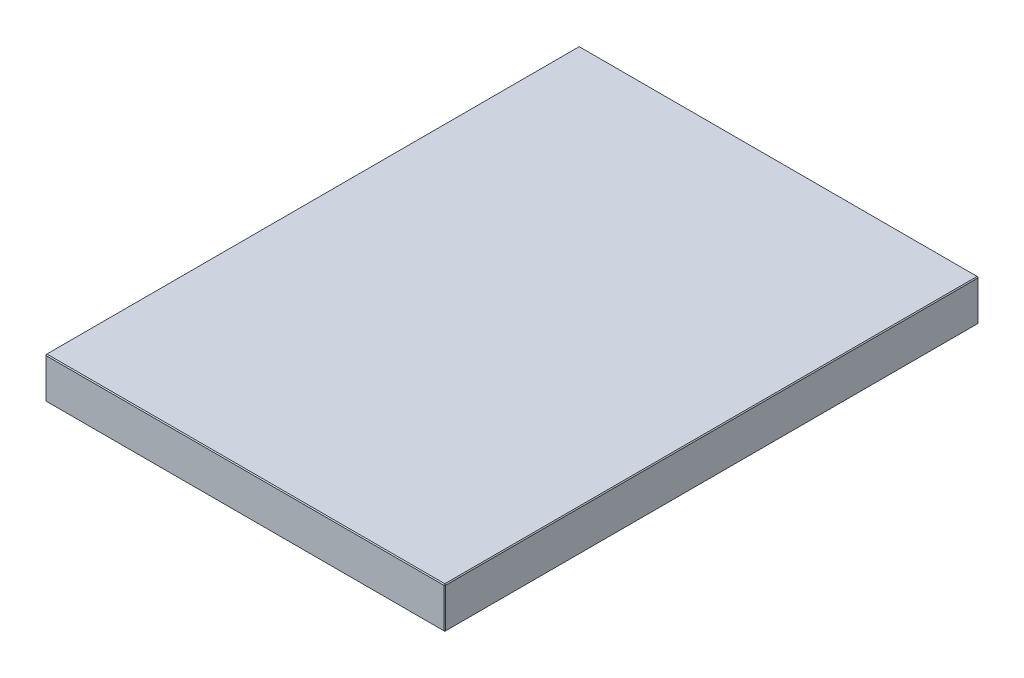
ISO-10303-21;
HEADER;
FILE_DESCRIPTION(('STEP AP214'),'2;1');
FILE_NAME('part.step','',(''),(''),'','','');
FILE_SCHEMA(('AUTOMOTIVE_DESIGN { 1 0 10303 214 1 1 1 1 }'));
ENDSEC;
DATA;
#1=APPLICATION_CONTEXT('core data for automotive mechanical design processes');
#2=APPLICATION_PROTOCOL_DEFINITION('international standard','automotive_design',2000,#1);
#3=PRODUCT_CONTEXT('',#1,'mechanical');
#4=PRODUCT('Part','Part','',(#3));
#5=PRODUCT_RELATED_PRODUCT_CATEGORY('part','',(#4));
#6=PRODUCT_DEFINITION_FORMATION('','',#4);
#7=PRODUCT_DEFINITION_CONTEXT('part definition',#1,'design');
#8=PRODUCT_DEFINITION('design','',#6,#7);
#9=PRODUCT_DEFINITION_SHAPE('','',#8);
#10=(LENGTH_UNIT() NAMED_UNIT(*) SI_UNIT(.MILLI.,.METRE.));
#11=(NAMED_UNIT(*) PLANE_ANGLE_UNIT() SI_UNIT($,.RADIAN.));
#12=(NAMED_UNIT(*) SI_UNIT($,.STERADIAN.) SOLID_ANGLE_UNIT());
#13=UNCERTAINTY_MEASURE_WITH_UNIT(LENGTH_MEASURE(1.E-05),#10,'distance_accuracy_value','');
#14=(GEOMETRIC_REPRESENTATION_CONTEXT(3) GLOBAL_UNCERTAINTY_ASSIGNED_CONTEXT((#13)) GLOBAL_UNIT_ASSIGNED_CONTEXT((#10,
#11,#12)) REPRESENTATION_CONTEXT('',''));
#15=CARTESIAN_POINT('',(0.,0.,0.));
#16=DIRECTION('',(0.,0.,1.));
#17=DIRECTION('',(1.,0.,0.));
#18=AXIS2_PLACEMENT_3D('',#15,#16,#17);
#19=CARTESIAN_POINT('',(223.,46.,298.));
#20=DIRECTION('',(-1.,0.,0.));
#21=DIRECTION('',(0.,0.,1.));
#22=AXIS2_PLACEMENT_3D('',#19,#20,#21);
#23=PLANE('',#22);
#24=DIRECTION('',(0.,0.,-1.));
#25=VECTOR('',#24,1.);
#26=CARTESIAN_POINT('',(223.,1.,-298.));
#27=LINE('',#26,#25);
#28=CARTESIAN_POINT('',(223.,1.,297.));
#29=VERTEX_POINT('',#28);
#30=CARTESIAN_POINT('',(223.,1.,-297.));
#31=VERTEX_POINT('',#30);
#32=EDGE_CURVE('E151',#29,#31,#27,.T.);
#33=ORIENTED_EDGE('',*,*,#32,.T.);
#34=DIRECTION('',(0.,1.,0.));
#35=VECTOR('',#34,1.);
#36=CARTESIAN_POINT('',(223.,46.,-297.));
#37=LINE('',#36,#35);
#38=CARTESIAN_POINT('',(223.,45.,-297.));
#39=VERTEX_POINT('',#38);
#40=EDGE_CURVE('E153',#31,#39,#37,.T.);
#41=ORIENTED_EDGE('',*,*,#40,.T.);
#42=DIRECTION('',(0.,0.,1.));
#43=VECTOR('',#42,1.);
#44=CARTESIAN_POINT('',(223.,45.,298.));
#45=LINE('',#44,#43);
#46=CARTESIAN_POINT('',(223.,45.,297.));
#47=VERTEX_POINT('',#46);
#48=EDGE_CURVE('E147',#39,#47,#45,.T.);
#49=ORIENTED_EDGE('',*,*,#48,.T.);
#50=DIRECTION('',(0.,-1.,0.));
#51=VECTOR('',#50,1.);
#52=CARTESIAN_POINT('',(223.,46.,297.));
#53=LINE('',#52,#51);
#54=EDGE_CURVE('E149',#47,#29,#53,.T.);
#55=ORIENTED_EDGE('',*,*,#54,.T.);
#56=EDGE_LOOP('',(#33,#41,#49,#55));
#57=FACE_BOUND('',#56,.T.);
#58=ADVANCED_FACE('F16',(#57),#23,.F.);
#59=CARTESIAN_POINT('',(-223.,46.,-298.));
#60=DIRECTION('',(0.,0.,1.));
#61=DIRECTION('',(1.,0.,0.));
#62=AXIS2_PLACEMENT_3D('',#59,#60,#61);
#63=PLANE('',#62);
#64=DIRECTION('',(0.,-1.,0.));
#65=VECTOR('',#64,1.);
#66=CARTESIAN_POINT('',(222.,46.,-298.));
#67=LINE('',#66,#65);
#68=CARTESIAN_POINT('',(222.,45.,-298.));
#69=VERTEX_POINT('',#68);
#70=CARTESIAN_POINT('',(222.,1.,-298.));
#71=VERTEX_POINT('',#70);
#72=EDGE_CURVE('E115',#69,#71,#67,.T.);
#73=ORIENTED_EDGE('',*,*,#72,.T.);
#74=DIRECTION('',(-1.,0.,0.));
#75=VECTOR('',#74,1.);
#76=CARTESIAN_POINT('',(-223.,1.,-298.));
#77=LINE('',#76,#75);
#78=CARTESIAN_POINT('',(-222.,1.,-298.));
#79=VERTEX_POINT('',#78);
#80=EDGE_CURVE('E111',#71,#79,#77,.T.);
#81=ORIENTED_EDGE('',*,*,#80,.T.);
#82=DIRECTION('',(0.,1.,0.));
#83=VECTOR('',#82,1.);
#84=CARTESIAN_POINT('',(-222.,46.,-298.));
#85=LINE('',#84,#83);
#86=CARTESIAN_POINT('',(-222.,45.,-298.));
#87=VERTEX_POINT('',#86);
#88=EDGE_CURVE('E103',#79,#87,#85,.T.);
#89=ORIENTED_EDGE('',*,*,#88,.T.);
#90=DIRECTION('',(1.,0.,0.));
#91=VECTOR('',#90,1.);
#92=CARTESIAN_POINT('',(-223.,45.,-298.));
#93=LINE('',#92,#91);
#94=EDGE_CURVE('E108',#87,#69,#93,.T.);
#95=ORIENTED_EDGE('',*,*,#94,.T.);
#96=EDGE_LOOP('',(#73,#81,#89,#95));
#97=FACE_BOUND('',#96,.T.);
#98=ADVANCED_FACE('F106',(#97),#63,.F.);
#99=CARTESIAN_POINT('',(-223.,46.,298.));
#100=DIRECTION('',(1.,0.,0.));
#101=DIRECTION('',(0.,0.,-1.));
#102=AXIS2_PLACEMENT_3D('',#99,#100,#101);
#103=PLANE('',#102);
#104=DIRECTION('',(0.,-1.,0.));
#105=VECTOR('',#104,1.);
#106=CARTESIAN_POINT('',(-223.,46.,-297.));
#107=LINE('',#106,#105);
#108=CARTESIAN_POINT('',(-223.,45.,-297.));
#109=VERTEX_POINT('',#108);
#110=CARTESIAN_POINT('',(-223.,1.,-297.));
#111=VERTEX_POINT('',#110);
#112=EDGE_CURVE('E123',#109,#111,#107,.T.);
#113=ORIENTED_EDGE('',*,*,#112,.T.);
#114=DIRECTION('',(0.,0.,1.));
#115=VECTOR('',#114,1.);
#116=CARTESIAN_POINT('',(-223.,1.,298.));
#117=LINE('',#116,#115);
#118=CARTESIAN_POINT('',(-223.,1.,297.));
#119=VERTEX_POINT('',#118);
#120=EDGE_CURVE('E161',#111,#119,#117,.T.);
#121=ORIENTED_EDGE('',*,*,#120,.T.);
#122=DIRECTION('',(0.,1.,0.));
#123=VECTOR('',#122,1.);
#124=CARTESIAN_POINT('',(-223.,46.,297.));
#125=LINE('',#124,#123);
#126=CARTESIAN_POINT('',(-223.,45.,297.));
#127=VERTEX_POINT('',#126);
#128=EDGE_CURVE('E158',#119,#127,#125,.T.);
#129=ORIENTED_EDGE('',*,*,#128,.T.);
#130=DIRECTION('',(0.,0.,-1.));
#131=VECTOR('',#130,1.);
#132=CARTESIAN_POINT('',(-223.,45.,298.));
#133=LINE('',#132,#131);
#134=EDGE_CURVE('E156',#127,#109,#133,.T.);
#135=ORIENTED_EDGE('',*,*,#134,.T.);
#136=EDGE_LOOP('',(#113,#121,#129,#135));
#137=FACE_BOUND('',#136,.T.);
#138=ADVANCED_FACE('F310',(#137),#103,.F.);
#139=CARTESIAN_POINT('',(-223.,46.,298.));
#140=DIRECTION('',(0.,0.,-1.));
#141=DIRECTION('',(-1.,0.,0.));
#142=AXIS2_PLACEMENT_3D('',#139,#140,#141);
#143=PLANE('',#142);
#144=DIRECTION('',(-1.,0.,0.));
#145=VECTOR('',#144,1.);
#146=CARTESIAN_POINT('',(-223.,45.,298.));
#147=LINE('',#146,#145);
#148=CARTESIAN_POINT('',(222.,45.,298.));
#149=VERTEX_POINT('',#148);
#150=CARTESIAN_POINT('',(-222.,45.,298.));
#151=VERTEX_POINT('',#150);
#152=EDGE_CURVE('E163',#149,#151,#147,.T.);
#153=ORIENTED_EDGE('',*,*,#152,.T.);
#154=DIRECTION('',(0.,-1.,0.));
#155=VECTOR('',#154,1.);
#156=CARTESIAN_POINT('',(-222.,46.,298.));
#157=LINE('',#156,#155);
#158=CARTESIAN_POINT('',(-222.,1.,298.));
#159=VERTEX_POINT('',#158);
#160=EDGE_CURVE('E169',#151,#159,#157,.T.);
#161=ORIENTED_EDGE('',*,*,#160,.T.);
#162=DIRECTION('',(1.,0.,0.));
#163=VECTOR('',#162,1.);
#164=CARTESIAN_POINT('',(223.,1.,298.));
#165=LINE('',#164,#163);
#166=CARTESIAN_POINT('',(222.,1.,298.));
#167=VERTEX_POINT('',#166);
#168=EDGE_CURVE('E167',#159,#167,#165,.T.);
#169=ORIENTED_EDGE('',*,*,#168,.T.);
#170=DIRECTION('',(0.,1.,0.));
#171=VECTOR('',#170,1.);
#172=CARTESIAN_POINT('',(222.,46.,298.));
#173=LINE('',#172,#171);
#174=EDGE_CURVE('E165',#167,#149,#173,.T.);
#175=ORIENTED_EDGE('',*,*,#174,.T.);
#176=EDGE_LOOP('',(#153,#161,#169,#175));
#177=FACE_BOUND('',#176,.T.);
#178=ADVANCED_FACE('F256',(#177),#143,.F.);
#179=CARTESIAN_POINT('',(0.,46.,0.));
#180=DIRECTION('',(0.,-1.,0.));
#181=DIRECTION('',(0.,0.,-1.));
#182=AXIS2_PLACEMENT_3D('',#179,#180,#181);
#183=PLANE('',#182);
#184=DIRECTION('',(0.,0.,1.));
#185=VECTOR('',#184,1.);
#186=CARTESIAN_POINT('',(-222.,46.,0.));
#187=LINE('',#186,#185);
#188=CARTESIAN_POINT('',(-222.,46.,-297.));
#189=VERTEX_POINT('',#188);
#190=CARTESIAN_POINT('',(-222.,46.,297.));
#191=VERTEX_POINT('',#190);
#192=EDGE_CURVE('E25',#189,#191,#187,.T.);
#193=ORIENTED_EDGE('',*,*,#192,.T.);
#194=DIRECTION('',(1.,0.,0.));
#195=VECTOR('',#194,1.);
#196=CARTESIAN_POINT('',(0.,46.,297.));
#197=LINE('',#196,#195);
#198=CARTESIAN_POINT('',(222.,46.,297.));
#199=VERTEX_POINT('',#198);
#200=EDGE_CURVE('E10',#191,#199,#197,.T.);
#201=ORIENTED_EDGE('',*,*,#200,.T.);
#202=DIRECTION('',(0.,0.,-1.));
#203=VECTOR('',#202,1.);
#204=CARTESIAN_POINT('',(222.,46.,0.));
#205=LINE('',#204,#203);
#206=CARTESIAN_POINT('',(222.,46.,-297.));
#207=VERTEX_POINT('',#206);
#208=EDGE_CURVE('E181',#199,#207,#205,.T.);
#209=ORIENTED_EDGE('',*,*,#208,.T.);
#210=DIRECTION('',(-1.,0.,0.));
#211=VECTOR('',#210,1.);
#212=CARTESIAN_POINT('',(0.,46.,-297.));
#213=LINE('',#212,#211);
#214=EDGE_CURVE('E36',#207,#189,#213,.T.);
#215=ORIENTED_EDGE('',*,*,#214,.T.);
#216=EDGE_LOOP('',(#193,#201,#209,#215));
#217=FACE_BOUND('',#216,.T.);
#218=ADVANCED_FACE('F271',(#217),#183,.F.);
#219=CARTESIAN_POINT('',(0.,0.,0.));
#220=DIRECTION('',(0.,-1.,0.));
#221=DIRECTION('',(0.,0.,-1.));
#222=AXIS2_PLACEMENT_3D('',#219,#220,#221);
#223=PLANE('',#222);
#224=DIRECTION('',(0.,0.,-1.));
#225=VECTOR('',#224,1.);
#226=CARTESIAN_POINT('',(-222.,0.,-298.));
#227=LINE('',#226,#225);
#228=CARTESIAN_POINT('',(-222.,0.,297.));
#229=VERTEX_POINT('',#228);
#230=CARTESIAN_POINT('',(-222.,0.,-297.));
#231=VERTEX_POINT('',#230);
#232=EDGE_CURVE('E176',#229,#231,#227,.T.);
#233=ORIENTED_EDGE('',*,*,#232,.T.);
#234=DIRECTION('',(1.,0.,0.));
#235=VECTOR('',#234,1.);
#236=CARTESIAN_POINT('',(223.,0.,-297.));
#237=LINE('',#236,#235);
#238=CARTESIAN_POINT('',(222.,0.,-297.));
#239=VERTEX_POINT('',#238);
#240=EDGE_CURVE('E178',#231,#239,#237,.T.);
#241=ORIENTED_EDGE('',*,*,#240,.T.);
#242=DIRECTION('',(0.,0.,1.));
#243=VECTOR('',#242,1.);
#244=CARTESIAN_POINT('',(222.,0.,298.));
#245=LINE('',#244,#243);
#246=CARTESIAN_POINT('',(222.,0.,297.));
#247=VERTEX_POINT('',#246);
#248=EDGE_CURVE('E172',#239,#247,#245,.T.);
#249=ORIENTED_EDGE('',*,*,#248,.T.);
#250=DIRECTION('',(-1.,0.,0.));
#251=VECTOR('',#250,1.);
#252=CARTESIAN_POINT('',(-223.,0.,297.));
#253=LINE('',#252,#251);
#254=EDGE_CURVE('E174',#247,#229,#253,.T.);
#255=ORIENTED_EDGE('',*,*,#254,.T.);
#256=EDGE_LOOP('',(#233,#241,#249,#255));
#257=FACE_BOUND('',#256,.T.);
#258=ADVANCED_FACE('F247',(#257),#223,.T.);
#259=CARTESIAN_POINT('',(-222.,46.,298.));
#260=DIRECTION('',(0.707106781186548,0.,-0.707106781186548));
#261=DIRECTION('',(0.,-1.,0.));
#262=AXIS2_PLACEMENT_3D('',#259,#260,#261);
#263=PLANE('',#262);
#264=DIRECTION('',(-0.707106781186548,0.,-0.707106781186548));
#265=VECTOR('',#264,1.);
#266=CARTESIAN_POINT('',(-223.,45.,297.));
#267=LINE('',#266,#265);
#268=EDGE_CURVE('E20',#127,#151,#267,.F.);
#269=ORIENTED_EDGE('',*,*,#268,.F.);
#270=ORIENTED_EDGE('',*,*,#128,.F.);
#271=DIRECTION('',(0.707106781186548,0.,0.707106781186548));
#272=VECTOR('',#271,1.);
#273=CARTESIAN_POINT('',(-222.,1.,298.));
#274=LINE('',#273,#272);
#275=EDGE_CURVE('E143',#159,#119,#274,.F.);
#276=ORIENTED_EDGE('',*,*,#275,.F.);
#277=ORIENTED_EDGE('',*,*,#160,.F.);
#278=EDGE_LOOP('',(#269,#270,#276,#277));
#279=FACE_BOUND('',#278,.T.);
#280=ADVANCED_FACE('F18',(#279),#263,.F.);
#281=CARTESIAN_POINT('',(-223.,45.,297.));
#282=DIRECTION('',(-0.577350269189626,0.577350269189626,0.577350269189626));
#283=DIRECTION('',(0.707106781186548,0.,0.707106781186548));
#284=AXIS2_PLACEMENT_3D('',#281,#282,#283);
#285=PLANE('',#284);
#286=DIRECTION('',(0.707106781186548,0.707106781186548,0.));
#287=VECTOR('',#286,1.);
#288=CARTESIAN_POINT('',(-223.,45.,297.));
#289=LINE('',#288,#287);
#290=EDGE_CURVE('E227',#127,#191,#289,.T.);
#291=ORIENTED_EDGE('',*,*,#290,.F.);
#292=ORIENTED_EDGE('',*,*,#268,.T.);
#293=DIRECTION('',(0.,-0.707106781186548,0.707106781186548));
#294=VECTOR('',#293,1.);
#295=CARTESIAN_POINT('',(-222.,45.5,297.5));
#296=LINE('',#295,#294);
#297=EDGE_CURVE('E229',#191,#151,#296,.T.);
#298=ORIENTED_EDGE('',*,*,#297,.F.);
#299=EDGE_LOOP('',(#291,#292,#298));
#300=FACE_BOUND('',#299,.T.);
#301=ADVANCED_FACE('F460',(#300),#285,.T.);
#302=CARTESIAN_POINT('',(-222.,1.,298.));
#303=DIRECTION('',(-0.577350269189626,-0.577350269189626,0.577350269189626));
#304=DIRECTION('',(0.707106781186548,0.,0.707106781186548));
#305=AXIS2_PLACEMENT_3D('',#302,#303,#304);
#306=PLANE('',#305);
#307=DIRECTION('',(0.,0.707106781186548,0.707106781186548));
#308=VECTOR('',#307,1.);
#309=CARTESIAN_POINT('',(-222.,1.,298.));
#310=LINE('',#309,#308);
#311=EDGE_CURVE('E221',#159,#229,#310,.F.);
#312=ORIENTED_EDGE('',*,*,#311,.F.);
#313=ORIENTED_EDGE('',*,*,#275,.T.);
#314=DIRECTION('',(0.707106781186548,-0.707106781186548,0.));
#315=VECTOR('',#314,1.);
#316=CARTESIAN_POINT('',(-222.5,0.5,297.));
#317=LINE('',#316,#315);
#318=EDGE_CURVE('E224',#229,#119,#317,.F.);
#319=ORIENTED_EDGE('',*,*,#318,.F.);
#320=EDGE_LOOP('',(#312,#313,#319));
#321=FACE_BOUND('',#320,.T.);
#322=ADVANCED_FACE('F236',(#321),#306,.T.);
#323=CARTESIAN_POINT('',(0.,46.,297.));
#324=DIRECTION('',(0.,-0.707106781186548,-0.707106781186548));
#325=DIRECTION('',(1.,0.,0.));
#326=AXIS2_PLACEMENT_3D('',#323,#324,#325);
#327=PLANE('',#326);
#328=ORIENTED_EDGE('',*,*,#297,.T.);
#329=ORIENTED_EDGE('',*,*,#152,.F.);
#330=DIRECTION('',(0.,0.707106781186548,-0.707106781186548));
#331=VECTOR('',#330,1.);
#332=CARTESIAN_POINT('',(222.,45.,298.));
#333=LINE('',#332,#331);
#334=EDGE_CURVE('E215',#199,#149,#333,.F.);
#335=ORIENTED_EDGE('',*,*,#334,.F.);
#336=ORIENTED_EDGE('',*,*,#200,.F.);
#337=EDGE_LOOP('',(#328,#329,#335,#336));
#338=FACE_BOUND('',#337,.T.);
#339=ADVANCED_FACE('F270',(#338),#327,.F.);
#340=CARTESIAN_POINT('',(-222.,46.,0.));
#341=DIRECTION('',(0.707106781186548,-0.707106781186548,0.));
#342=DIRECTION('',(0.,0.,1.));
#343=AXIS2_PLACEMENT_3D('',#340,#341,#342);
#344=PLANE('',#343);
#345=ORIENTED_EDGE('',*,*,#290,.T.);
#346=ORIENTED_EDGE('',*,*,#192,.F.);
#347=DIRECTION('',(-0.707106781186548,-0.707106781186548,0.));
#348=VECTOR('',#347,1.);
#349=CARTESIAN_POINT('',(-222.5,45.5,-297.));
#350=LINE('',#349,#348);
#351=EDGE_CURVE('E127',#109,#189,#350,.F.);
#352=ORIENTED_EDGE('',*,*,#351,.F.);
#353=ORIENTED_EDGE('',*,*,#134,.F.);
#354=EDGE_LOOP('',(#345,#346,#352,#353));
#355=FACE_BOUND('',#354,.T.);
#356=ADVANCED_FACE('F437',(#355),#344,.F.);
#357=CARTESIAN_POINT('',(-223.,46.,-297.));
#358=DIRECTION('',(0.707106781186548,0.,0.707106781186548));
#359=DIRECTION('',(0.,-1.,0.));
#360=AXIS2_PLACEMENT_3D('',#357,#358,#359);
#361=PLANE('',#360);
#362=DIRECTION('',(-0.707106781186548,0.,0.707106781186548));
#363=VECTOR('',#362,1.);
#364=CARTESIAN_POINT('',(-223.,1.,-297.));
#365=LINE('',#364,#363);
#366=EDGE_CURVE('E128',#111,#79,#365,.F.);
#367=ORIENTED_EDGE('',*,*,#366,.F.);
#368=ORIENTED_EDGE('',*,*,#112,.F.);
#369=DIRECTION('',(0.707106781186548,0.,-0.707106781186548));
#370=VECTOR('',#369,1.);
#371=CARTESIAN_POINT('',(-222.,45.,-298.));
#372=LINE('',#371,#370);
#373=EDGE_CURVE('E119',#87,#109,#372,.F.);
#374=ORIENTED_EDGE('',*,*,#373,.F.);
#375=ORIENTED_EDGE('',*,*,#88,.F.);
#376=EDGE_LOOP('',(#367,#368,#374,#375));
#377=FACE_BOUND('',#376,.T.);
#378=ADVANCED_FACE('F121',(#377),#361,.F.);
#379=CARTESIAN_POINT('',(-223.,1.,298.));
#380=DIRECTION('',(-0.707106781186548,-0.707106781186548,0.));
#381=DIRECTION('',(0.,0.,-1.));
#382=AXIS2_PLACEMENT_3D('',#379,#380,#381);
#383=PLANE('',#382);
#384=ORIENTED_EDGE('',*,*,#318,.T.);
#385=ORIENTED_EDGE('',*,*,#120,.F.);
#386=DIRECTION('',(-0.707106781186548,0.707106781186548,0.));
#387=VECTOR('',#386,1.);
#388=CARTESIAN_POINT('',(-223.,1.,-297.));
#389=LINE('',#388,#387);
#390=EDGE_CURVE('E211',#231,#111,#389,.T.);
#391=ORIENTED_EDGE('',*,*,#390,.F.);
#392=ORIENTED_EDGE('',*,*,#232,.F.);
#393=EDGE_LOOP('',(#384,#385,#391,#392));
#394=FACE_BOUND('',#393,.T.);
#395=ADVANCED_FACE('F243',(#394),#383,.T.);
#396=CARTESIAN_POINT('',(-223.,1.,298.));
#397=DIRECTION('',(0.,-0.707106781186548,0.707106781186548));
#398=DIRECTION('',(-1.,0.,0.));
#399=AXIS2_PLACEMENT_3D('',#396,#397,#398);
#400=PLANE('',#399);
#401=ORIENTED_EDGE('',*,*,#311,.T.);
#402=ORIENTED_EDGE('',*,*,#254,.F.);
#403=DIRECTION('',(0.,-0.707106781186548,-0.707106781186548));
#404=VECTOR('',#403,1.);
#405=CARTESIAN_POINT('',(222.,1.,298.));
#406=LINE('',#405,#404);
#407=EDGE_CURVE('E208',#167,#247,#406,.T.);
#408=ORIENTED_EDGE('',*,*,#407,.F.);
#409=ORIENTED_EDGE('',*,*,#168,.F.);
#410=EDGE_LOOP('',(#401,#402,#408,#409));
#411=FACE_BOUND('',#410,.T.);
#412=ADVANCED_FACE('F253',(#411),#400,.T.);
#413=CARTESIAN_POINT('',(223.,46.,297.));
#414=DIRECTION('',(-0.707106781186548,0.,-0.707106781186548));
#415=DIRECTION('',(0.,-1.,0.));
#416=AXIS2_PLACEMENT_3D('',#413,#414,#415);
#417=PLANE('',#416);
#418=DIRECTION('',(-0.707106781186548,0.,0.707106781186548));
#419=VECTOR('',#418,1.);
#420=CARTESIAN_POINT('',(222.,45.,298.));
#421=LINE('',#420,#419);
#422=EDGE_CURVE('E218',#149,#47,#421,.F.);
#423=ORIENTED_EDGE('',*,*,#422,.F.);
#424=ORIENTED_EDGE('',*,*,#174,.F.);
#425=DIRECTION('',(0.707106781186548,0.,-0.707106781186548));
#426=VECTOR('',#425,1.);
#427=CARTESIAN_POINT('',(222.,1.,298.));
#428=LINE('',#427,#426);
#429=EDGE_CURVE('E205',#29,#167,#428,.F.);
#430=ORIENTED_EDGE('',*,*,#429,.F.);
#431=ORIENTED_EDGE('',*,*,#54,.F.);
#432=EDGE_LOOP('',(#423,#424,#430,#431));
#433=FACE_BOUND('',#432,.T.);
#434=ADVANCED_FACE('F261',(#433),#417,.F.);
#435=CARTESIAN_POINT('',(222.,45.,298.));
#436=DIRECTION('',(0.577350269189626,0.577350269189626,0.577350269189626));
#437=DIRECTION('',(0.707106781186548,0.,-0.707106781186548));
#438=AXIS2_PLACEMENT_3D('',#435,#436,#437);
#439=PLANE('',#438);
#440=ORIENTED_EDGE('',*,*,#334,.T.);
#441=ORIENTED_EDGE('',*,*,#422,.T.);
#442=DIRECTION('',(0.707106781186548,-0.707106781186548,0.));
#443=VECTOR('',#442,1.);
#444=CARTESIAN_POINT('',(222.5,45.5,297.));
#445=LINE('',#444,#443);
#446=EDGE_CURVE('E134',#199,#47,#445,.T.);
#447=ORIENTED_EDGE('',*,*,#446,.F.);
#448=EDGE_LOOP('',(#440,#441,#447));
#449=FACE_BOUND('',#448,.T.);
#450=ADVANCED_FACE('F267',(#449),#439,.T.);
#451=CARTESIAN_POINT('',(-222.,45.,-298.));
#452=DIRECTION('',(-0.577350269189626,0.577350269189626,-0.577350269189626));
#453=DIRECTION('',(-0.707106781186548,0.,0.707106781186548));
#454=AXIS2_PLACEMENT_3D('',#451,#452,#453);
#455=PLANE('',#454);
#456=ORIENTED_EDGE('',*,*,#373,.T.);
#457=ORIENTED_EDGE('',*,*,#351,.T.);
#458=DIRECTION('',(0.,0.707106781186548,0.707106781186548));
#459=VECTOR('',#458,1.);
#460=CARTESIAN_POINT('',(-222.,45.,-298.));
#461=LINE('',#460,#459);
#462=EDGE_CURVE('E131',#87,#189,#461,.T.);
#463=ORIENTED_EDGE('',*,*,#462,.F.);
#464=EDGE_LOOP('',(#456,#457,#463));
#465=FACE_BOUND('',#464,.T.);
#466=ADVANCED_FACE('F132',(#465),#455,.T.);
#467=CARTESIAN_POINT('',(-223.,1.,-297.));
#468=DIRECTION('',(-0.577350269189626,-0.577350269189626,-0.577350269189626));
#469=DIRECTION('',(-0.707106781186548,0.,0.707106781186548));
#470=AXIS2_PLACEMENT_3D('',#467,#468,#469);
#471=PLANE('',#470);
#472=ORIENTED_EDGE('',*,*,#390,.T.);
#473=ORIENTED_EDGE('',*,*,#366,.T.);
#474=DIRECTION('',(0.,-0.707106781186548,0.707106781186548));
#475=VECTOR('',#474,1.);
#476=CARTESIAN_POINT('',(-222.,0.5,-297.5));
#477=LINE('',#476,#475);
#478=EDGE_CURVE('E135',#231,#79,#477,.F.);
#479=ORIENTED_EDGE('',*,*,#478,.F.);
#480=EDGE_LOOP('',(#472,#473,#479));
#481=FACE_BOUND('',#480,.T.);
#482=ADVANCED_FACE('F290',(#481),#471,.T.);
#483=CARTESIAN_POINT('',(222.,1.,298.));
#484=DIRECTION('',(0.577350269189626,-0.577350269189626,0.577350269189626));
#485=DIRECTION('',(0.707106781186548,0.,-0.707106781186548));
#486=AXIS2_PLACEMENT_3D('',#483,#484,#485);
#487=PLANE('',#486);
#488=ORIENTED_EDGE('',*,*,#429,.T.);
#489=ORIENTED_EDGE('',*,*,#407,.T.);
#490=DIRECTION('',(0.707106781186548,0.707106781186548,0.));
#491=VECTOR('',#490,1.);
#492=CARTESIAN_POINT('',(222.5,0.5,297.));
#493=LINE('',#492,#491);
#494=EDGE_CURVE('E198',#29,#247,#493,.F.);
#495=ORIENTED_EDGE('',*,*,#494,.F.);
#496=EDGE_LOOP('',(#488,#489,#495));
#497=FACE_BOUND('',#496,.T.);
#498=ADVANCED_FACE('F292',(#497),#487,.T.);
#499=CARTESIAN_POINT('',(222.,46.,0.));
#500=DIRECTION('',(-0.707106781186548,-0.707106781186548,0.));
#501=DIRECTION('',(0.,0.,-1.));
#502=AXIS2_PLACEMENT_3D('',#499,#500,#501);
#503=PLANE('',#502);
#504=ORIENTED_EDGE('',*,*,#446,.T.);
#505=ORIENTED_EDGE('',*,*,#48,.F.);
#506=DIRECTION('',(-0.707106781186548,0.707106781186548,0.));
#507=VECTOR('',#506,1.);
#508=CARTESIAN_POINT('',(223.,45.,-297.));
#509=LINE('',#508,#507);
#510=EDGE_CURVE('E195',#207,#39,#509,.F.);
#511=ORIENTED_EDGE('',*,*,#510,.F.);
#512=ORIENTED_EDGE('',*,*,#208,.F.);
#513=EDGE_LOOP('',(#504,#505,#511,#512));
#514=FACE_BOUND('',#513,.T.);
#515=ADVANCED_FACE('F275',(#514),#503,.F.);
#516=CARTESIAN_POINT('',(0.,46.,-297.));
#517=DIRECTION('',(0.,-0.707106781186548,0.707106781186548));
#518=DIRECTION('',(-1.,0.,0.));
#519=AXIS2_PLACEMENT_3D('',#516,#517,#518);
#520=PLANE('',#519);
#521=ORIENTED_EDGE('',*,*,#462,.T.);
#522=ORIENTED_EDGE('',*,*,#214,.F.);
#523=DIRECTION('',(0.,-0.707106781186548,-0.707106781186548));
#524=VECTOR('',#523,1.);
#525=CARTESIAN_POINT('',(222.,45.5,-297.5));
#526=LINE('',#525,#524);
#527=EDGE_CURVE('E139',#69,#207,#526,.F.);
#528=ORIENTED_EDGE('',*,*,#527,.F.);
#529=ORIENTED_EDGE('',*,*,#94,.F.);
#530=EDGE_LOOP('',(#521,#522,#528,#529));
#531=FACE_BOUND('',#530,.T.);
#532=ADVANCED_FACE('F137',(#531),#520,.F.);
#533=CARTESIAN_POINT('',(-223.,1.,-298.));
#534=DIRECTION('',(0.,-0.707106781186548,-0.707106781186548));
#535=DIRECTION('',(1.,0.,0.));
#536=AXIS2_PLACEMENT_3D('',#533,#534,#535);
#537=PLANE('',#536);
#538=ORIENTED_EDGE('',*,*,#478,.T.);
#539=ORIENTED_EDGE('',*,*,#80,.F.);
#540=DIRECTION('',(0.,0.707106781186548,-0.707106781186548));
#541=VECTOR('',#540,1.);
#542=CARTESIAN_POINT('',(222.,1.,-298.));
#543=LINE('',#542,#541);
#544=EDGE_CURVE('E191',#239,#71,#543,.T.);
#545=ORIENTED_EDGE('',*,*,#544,.F.);
#546=ORIENTED_EDGE('',*,*,#240,.F.);
#547=EDGE_LOOP('',(#538,#539,#545,#546));
#548=FACE_BOUND('',#547,.T.);
#549=ADVANCED_FACE('F288',(#548),#537,.T.);
#550=CARTESIAN_POINT('',(223.,1.,298.));
#551=DIRECTION('',(0.707106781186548,-0.707106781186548,0.));
#552=DIRECTION('',(0.,0.,1.));
#553=AXIS2_PLACEMENT_3D('',#550,#551,#552);
#554=PLANE('',#553);
#555=ORIENTED_EDGE('',*,*,#494,.T.);
#556=ORIENTED_EDGE('',*,*,#248,.F.);
#557=DIRECTION('',(-0.707106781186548,-0.707106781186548,0.));
#558=VECTOR('',#557,1.);
#559=CARTESIAN_POINT('',(222.5,0.5,-297.));
#560=LINE('',#559,#558);
#561=EDGE_CURVE('E189',#31,#239,#560,.T.);
#562=ORIENTED_EDGE('',*,*,#561,.F.);
#563=ORIENTED_EDGE('',*,*,#32,.F.);
#564=EDGE_LOOP('',(#555,#556,#562,#563));
#565=FACE_BOUND('',#564,.T.);
#566=ADVANCED_FACE('F320',(#565),#554,.T.);
#567=CARTESIAN_POINT('',(223.,45.,-297.));
#568=DIRECTION('',(0.577350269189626,0.577350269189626,-0.577350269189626));
#569=DIRECTION('',(-0.707106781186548,0.,-0.707106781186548));
#570=AXIS2_PLACEMENT_3D('',#567,#568,#569);
#571=PLANE('',#570);
#572=ORIENTED_EDGE('',*,*,#527,.T.);
#573=ORIENTED_EDGE('',*,*,#510,.T.);
#574=DIRECTION('',(0.707106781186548,0.,0.707106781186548));
#575=VECTOR('',#574,1.);
#576=CARTESIAN_POINT('',(223.,45.,-297.));
#577=LINE('',#576,#575);
#578=EDGE_CURVE('E187',#69,#39,#577,.T.);
#579=ORIENTED_EDGE('',*,*,#578,.F.);
#580=EDGE_LOOP('',(#572,#573,#579));
#581=FACE_BOUND('',#580,.T.);
#582=ADVANCED_FACE('F277',(#581),#571,.T.);
#583=CARTESIAN_POINT('',(222.,1.,-298.));
#584=DIRECTION('',(0.577350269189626,-0.577350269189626,-0.577350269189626));
#585=DIRECTION('',(-0.707106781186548,0.,-0.707106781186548));
#586=AXIS2_PLACEMENT_3D('',#583,#584,#585);
#587=PLANE('',#586);
#588=ORIENTED_EDGE('',*,*,#561,.T.);
#589=ORIENTED_EDGE('',*,*,#544,.T.);
#590=DIRECTION('',(-0.707106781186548,0.,-0.707106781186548));
#591=VECTOR('',#590,1.);
#592=CARTESIAN_POINT('',(222.,1.,-298.));
#593=LINE('',#592,#591);
#594=EDGE_CURVE('E185',#31,#71,#593,.T.);
#595=ORIENTED_EDGE('',*,*,#594,.F.);
#596=EDGE_LOOP('',(#588,#589,#595));
#597=FACE_BOUND('',#596,.T.);
#598=ADVANCED_FACE('F285',(#597),#587,.T.);
#599=CARTESIAN_POINT('',(222.,46.,-298.));
#600=DIRECTION('',(-0.707106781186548,0.,0.707106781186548));
#601=DIRECTION('',(0.,-1.,0.));
#602=AXIS2_PLACEMENT_3D('',#599,#600,#601);
#603=PLANE('',#602);
#604=ORIENTED_EDGE('',*,*,#578,.T.);
#605=ORIENTED_EDGE('',*,*,#40,.F.);
#606=ORIENTED_EDGE('',*,*,#594,.T.);
#607=ORIENTED_EDGE('',*,*,#72,.F.);
#608=EDGE_LOOP('',(#604,#605,#606,#607));
#609=FACE_BOUND('',#608,.T.);
#610=ADVANCED_FACE('F281',(#609),#603,.F.);
#611=CLOSED_SHELL('',(#58,#98,#138,#178,#218,#258,#280,#301,#322,#339,#356,#378,#395,#412,#434,
#450,#466,#482,#498,#515,#532,#549,#566,#582,#598,#610));
#612=MANIFOLD_SOLID_BREP('B1',#611);
#613=ADVANCED_BREP_SHAPE_REPRESENTATION('',(#18,#612),#14);
#614=SHAPE_DEFINITION_REPRESENTATION(#9,#613);
ENDSEC;
END-ISO-10303-21;
